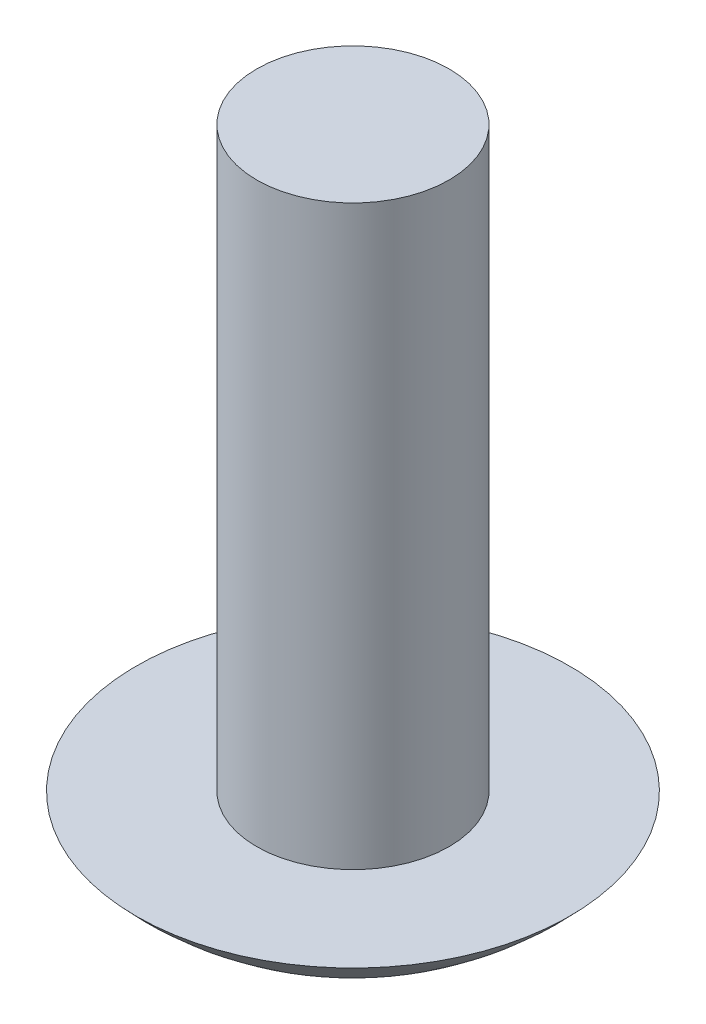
ISO-10303-21;
HEADER;
FILE_DESCRIPTION(('STEP AP214'),'2;1');
FILE_NAME('part.step','',(''),(''),'','','');
FILE_SCHEMA(('AUTOMOTIVE_DESIGN { 1 0 10303 214 1 1 1 1 }'));
ENDSEC;
DATA;
#1=APPLICATION_CONTEXT('core data for automotive mechanical design processes');
#2=APPLICATION_PROTOCOL_DEFINITION('international standard','automotive_design',2000,#1);
#3=PRODUCT_CONTEXT('',#1,'mechanical');
#4=PRODUCT('Part','Part','',(#3));
#5=PRODUCT_RELATED_PRODUCT_CATEGORY('part','',(#4));
#6=PRODUCT_DEFINITION_FORMATION('','',#4);
#7=PRODUCT_DEFINITION_CONTEXT('part definition',#1,'design');
#8=PRODUCT_DEFINITION('design','',#6,#7);
#9=PRODUCT_DEFINITION_SHAPE('','',#8);
#10=(LENGTH_UNIT() NAMED_UNIT(*) SI_UNIT(.MILLI.,.METRE.));
#11=(NAMED_UNIT(*) PLANE_ANGLE_UNIT() SI_UNIT($,.RADIAN.));
#12=(NAMED_UNIT(*) SI_UNIT($,.STERADIAN.) SOLID_ANGLE_UNIT());
#13=UNCERTAINTY_MEASURE_WITH_UNIT(LENGTH_MEASURE(1.E-05),#10,'distance_accuracy_value','');
#14=(GEOMETRIC_REPRESENTATION_CONTEXT(3) GLOBAL_UNCERTAINTY_ASSIGNED_CONTEXT((#13)) GLOBAL_UNIT_ASSIGNED_CONTEXT((#10,
#11,#12)) REPRESENTATION_CONTEXT('',''));
#15=CARTESIAN_POINT('',(0.,0.,0.));
#16=DIRECTION('',(0.,0.,1.));
#17=DIRECTION('',(1.,0.,0.));
#18=AXIS2_PLACEMENT_3D('',#15,#16,#17);
#19=CARTESIAN_POINT('',(0.,22.225,3.175));
#20=DIRECTION('',(0.,1.,0.));
#21=DIRECTION('',(0.,0.,1.));
#22=AXIS2_PLACEMENT_3D('',#19,#20,#21);
#23=PLANE('',#22);
#24=CARTESIAN_POINT('',(0.,22.225,0.));
#25=DIRECTION('',(0.,1.,0.));
#26=DIRECTION('',(0.,0.,1.));
#27=AXIS2_PLACEMENT_3D('',#24,#25,#26);
#28=CIRCLE('',#27,3.175);
#29=CARTESIAN_POINT('',(0.,22.225,3.175));
#30=VERTEX_POINT('',#29);
#31=EDGE_CURVE('E40',#30,#30,#28,.T.);
#32=ORIENTED_EDGE('',*,*,#31,.T.);
#33=EDGE_LOOP('',(#32));
#34=FACE_BOUND('',#33,.T.);
#35=ADVANCED_FACE('F30',(#34),#23,.T.);
#36=CARTESIAN_POINT('',(0.,9.6385126,0.));
#37=DIRECTION('',(0.,1.,0.));
#38=DIRECTION('',(0.,0.,1.));
#39=AXIS2_PLACEMENT_3D('',#36,#37,#38);
#40=SPHERICAL_SURFACE('',#39,9.6385126);
#41=CARTESIAN_POINT('',(0.,3.17499999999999,0.));
#42=DIRECTION('',(0.,1.,0.));
#43=DIRECTION('',(0.,0.,1.));
#44=AXIS2_PLACEMENT_3D('',#41,#42,#43);
#45=CIRCLE('',#44,7.15009999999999);
#46=CARTESIAN_POINT('',(0.,3.17499999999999,7.15009999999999));
#47=VERTEX_POINT('',#46);
#48=EDGE_CURVE('E10',#47,#47,#45,.T.);
#49=ORIENTED_EDGE('',*,*,#48,.F.);
#50=EDGE_LOOP('',(#49));
#51=FACE_BOUND('',#50,.T.);
#52=ADVANCED_FACE('F55',(#51),#40,.T.);
#53=CARTESIAN_POINT('',(0.,3.175,7.1501));
#54=DIRECTION('',(0.,1.,0.));
#55=DIRECTION('',(0.,0.,1.));
#56=AXIS2_PLACEMENT_3D('',#53,#54,#55);
#57=PLANE('',#56);
#58=ORIENTED_EDGE('',*,*,#48,.T.);
#59=EDGE_LOOP('',(#58));
#60=FACE_BOUND('',#59,.T.);
#61=CARTESIAN_POINT('',(0.,3.175,0.));
#62=DIRECTION('',(0.,1.,0.));
#63=DIRECTION('',(0.,0.,1.));
#64=AXIS2_PLACEMENT_3D('',#61,#62,#63);
#65=CIRCLE('',#64,3.175);
#66=CARTESIAN_POINT('',(0.,3.175,3.175));
#67=VERTEX_POINT('',#66);
#68=EDGE_CURVE('E36',#67,#67,#65,.T.);
#69=ORIENTED_EDGE('',*,*,#68,.F.);
#70=EDGE_LOOP('',(#69));
#71=FACE_BOUND('',#70,.T.);
#72=ADVANCED_FACE('F50',(#60,#71),#57,.T.);
#73=CARTESIAN_POINT('',(0.,22.225,0.));
#74=DIRECTION('',(0.,1.,0.));
#75=DIRECTION('',(0.,0.,1.));
#76=AXIS2_PLACEMENT_3D('',#73,#74,#75);
#77=CYLINDRICAL_SURFACE('',#76,3.175);
#78=ORIENTED_EDGE('',*,*,#68,.T.);
#79=EDGE_LOOP('',(#78));
#80=FACE_BOUND('',#79,.T.);
#81=ORIENTED_EDGE('',*,*,#31,.F.);
#82=EDGE_LOOP('',(#81));
#83=FACE_BOUND('',#82,.T.);
#84=ADVANCED_FACE('F48',(#80,#83),#77,.T.);
#85=CLOSED_SHELL('',(#35,#52,#72,#84));
#86=MANIFOLD_SOLID_BREP('B2',#85);
#87=ADVANCED_BREP_SHAPE_REPRESENTATION('',(#18,#86),#14);
#88=SHAPE_DEFINITION_REPRESENTATION(#9,#87);
ENDSEC;
END-ISO-10303-21;
